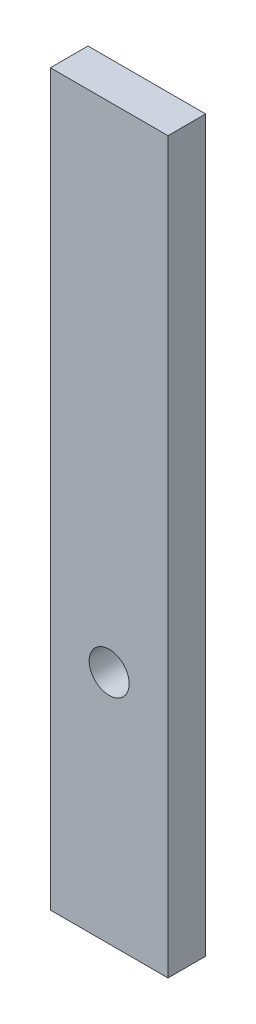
ISO-10303-21;
HEADER;
FILE_DESCRIPTION(('STEP AP214'),'2;1');
FILE_NAME('part.step','',(''),(''),'','','');
FILE_SCHEMA(('AUTOMOTIVE_DESIGN { 1 0 10303 214 1 1 1 1 }'));
ENDSEC;
DATA;
#1=APPLICATION_CONTEXT('core data for automotive mechanical design processes');
#2=APPLICATION_PROTOCOL_DEFINITION('international standard','automotive_design',2000,#1);
#3=PRODUCT_CONTEXT('',#1,'mechanical');
#4=PRODUCT('Part','Part','',(#3));
#5=PRODUCT_RELATED_PRODUCT_CATEGORY('part','',(#4));
#6=PRODUCT_DEFINITION_FORMATION('','',#4);
#7=PRODUCT_DEFINITION_CONTEXT('part definition',#1,'design');
#8=PRODUCT_DEFINITION('design','',#6,#7);
#9=PRODUCT_DEFINITION_SHAPE('','',#8);
#10=(LENGTH_UNIT() NAMED_UNIT(*) SI_UNIT(.MILLI.,.METRE.));
#11=(NAMED_UNIT(*) PLANE_ANGLE_UNIT() SI_UNIT($,.RADIAN.));
#12=(NAMED_UNIT(*) SI_UNIT($,.STERADIAN.) SOLID_ANGLE_UNIT());
#13=UNCERTAINTY_MEASURE_WITH_UNIT(LENGTH_MEASURE(1.E-05),#10,'distance_accuracy_value','');
#14=(GEOMETRIC_REPRESENTATION_CONTEXT(3) GLOBAL_UNCERTAINTY_ASSIGNED_CONTEXT((#13)) GLOBAL_UNIT_ASSIGNED_CONTEXT((#10,
#11,#12)) REPRESENTATION_CONTEXT('',''));
#15=CARTESIAN_POINT('',(0.,0.,0.));
#16=DIRECTION('',(0.,0.,1.));
#17=DIRECTION('',(1.,0.,0.));
#18=AXIS2_PLACEMENT_3D('',#15,#16,#17);
#19=CARTESIAN_POINT('',(0.,155.,0.));
#20=DIRECTION('',(0.,0.,-1.));
#21=DIRECTION('',(-1.,0.,0.));
#22=AXIS2_PLACEMENT_3D('',#19,#20,#21);
#23=PLANE('',#22);
#24=DIRECTION('',(0.,-1.,0.));
#25=VECTOR('',#24,1.);
#26=CARTESIAN_POINT('',(0.,0.,0.));
#27=LINE('',#26,#25);
#28=CARTESIAN_POINT('',(0.,155.,0.));
#29=VERTEX_POINT('',#28);
#30=CARTESIAN_POINT('',(0.,0.,0.));
#31=VERTEX_POINT('',#30);
#32=EDGE_CURVE('E113',#29,#31,#27,.T.);
#33=ORIENTED_EDGE('',*,*,#32,.F.);
#34=DIRECTION('',(-1.,0.,0.));
#35=VECTOR('',#34,1.);
#36=CARTESIAN_POINT('',(0.,155.,0.));
#37=LINE('',#36,#35);
#38=CARTESIAN_POINT('',(25.,155.,0.));
#39=VERTEX_POINT('',#38);
#40=EDGE_CURVE('E85',#39,#29,#37,.T.);
#41=ORIENTED_EDGE('',*,*,#40,.F.);
#42=DIRECTION('',(0.,1.,0.));
#43=VECTOR('',#42,1.);
#44=CARTESIAN_POINT('',(25.,0.,0.));
#45=LINE('',#44,#43);
#46=CARTESIAN_POINT('',(25.,0.,0.));
#47=VERTEX_POINT('',#46);
#48=EDGE_CURVE('E79',#47,#39,#45,.T.);
#49=ORIENTED_EDGE('',*,*,#48,.F.);
#50=DIRECTION('',(1.,0.,0.));
#51=VECTOR('',#50,1.);
#52=CARTESIAN_POINT('',(0.,0.,0.));
#53=LINE('',#52,#51);
#54=EDGE_CURVE('E102',#31,#47,#53,.T.);
#55=ORIENTED_EDGE('',*,*,#54,.F.);
#56=EDGE_LOOP('',(#33,#41,#49,#55));
#57=FACE_BOUND('',#56,.T.);
#58=CARTESIAN_POINT('',(12.5,50.,0.));
#59=DIRECTION('',(0.,0.,1.));
#60=DIRECTION('',(1.,0.,0.));
#61=AXIS2_PLACEMENT_3D('',#58,#59,#60);
#62=CIRCLE('',#61,4.25);
#63=CARTESIAN_POINT('',(16.75,50.,0.));
#64=VERTEX_POINT('',#63);
#65=EDGE_CURVE('E137',#64,#64,#62,.T.);
#66=ORIENTED_EDGE('',*,*,#65,.T.);
#67=EDGE_LOOP('',(#66));
#68=FACE_BOUND('',#67,.T.);
#69=ADVANCED_FACE('F44',(#57,#68),#23,.T.);
#70=CARTESIAN_POINT('',(0.,0.,8.));
#71=DIRECTION('',(1.,0.,0.));
#72=DIRECTION('',(0.,0.,-1.));
#73=AXIS2_PLACEMENT_3D('',#70,#71,#72);
#74=PLANE('',#73);
#75=ORIENTED_EDGE('',*,*,#32,.T.);
#76=DIRECTION('',(0.,0.,-1.));
#77=VECTOR('',#76,1.);
#78=CARTESIAN_POINT('',(0.,0.,8.));
#79=LINE('',#78,#77);
#80=CARTESIAN_POINT('',(0.,0.,8.));
#81=VERTEX_POINT('',#80);
#82=EDGE_CURVE('E11',#81,#31,#79,.T.);
#83=ORIENTED_EDGE('',*,*,#82,.F.);
#84=DIRECTION('',(0.,-1.,0.));
#85=VECTOR('',#84,1.);
#86=CARTESIAN_POINT('',(0.,0.,8.));
#87=LINE('',#86,#85);
#88=CARTESIAN_POINT('',(0.,155.,8.));
#89=VERTEX_POINT('',#88);
#90=EDGE_CURVE('E97',#89,#81,#87,.T.);
#91=ORIENTED_EDGE('',*,*,#90,.F.);
#92=DIRECTION('',(0.,0.,-1.));
#93=VECTOR('',#92,1.);
#94=CARTESIAN_POINT('',(0.,155.,8.));
#95=LINE('',#94,#93);
#96=EDGE_CURVE('E109',#89,#29,#95,.T.);
#97=ORIENTED_EDGE('',*,*,#96,.T.);
#98=EDGE_LOOP('',(#75,#83,#91,#97));
#99=FACE_BOUND('',#98,.T.);
#100=ADVANCED_FACE('F46',(#99),#74,.F.);
#101=CARTESIAN_POINT('',(0.,0.,8.));
#102=DIRECTION('',(0.,1.,0.));
#103=DIRECTION('',(0.,0.,1.));
#104=AXIS2_PLACEMENT_3D('',#101,#102,#103);
#105=PLANE('',#104);
#106=ORIENTED_EDGE('',*,*,#54,.T.);
#107=DIRECTION('',(0.,0.,-1.));
#108=VECTOR('',#107,1.);
#109=CARTESIAN_POINT('',(25.,0.,8.));
#110=LINE('',#109,#108);
#111=CARTESIAN_POINT('',(25.,0.,8.));
#112=VERTEX_POINT('',#111);
#113=EDGE_CURVE('E54',#112,#47,#110,.T.);
#114=ORIENTED_EDGE('',*,*,#113,.F.);
#115=DIRECTION('',(1.,0.,0.));
#116=VECTOR('',#115,1.);
#117=CARTESIAN_POINT('',(0.,0.,8.));
#118=LINE('',#117,#116);
#119=EDGE_CURVE('E92',#81,#112,#118,.T.);
#120=ORIENTED_EDGE('',*,*,#119,.F.);
#121=ORIENTED_EDGE('',*,*,#82,.T.);
#122=EDGE_LOOP('',(#106,#114,#120,#121));
#123=FACE_BOUND('',#122,.T.);
#124=ADVANCED_FACE('F101',(#123),#105,.F.);
#125=CARTESIAN_POINT('',(25.,0.,8.));
#126=DIRECTION('',(-1.,0.,0.));
#127=DIRECTION('',(0.,0.,1.));
#128=AXIS2_PLACEMENT_3D('',#125,#126,#127);
#129=PLANE('',#128);
#130=ORIENTED_EDGE('',*,*,#48,.T.);
#131=DIRECTION('',(0.,0.,-1.));
#132=VECTOR('',#131,1.);
#133=CARTESIAN_POINT('',(25.,155.,8.));
#134=LINE('',#133,#132);
#135=CARTESIAN_POINT('',(25.,155.,8.));
#136=VERTEX_POINT('',#135);
#137=EDGE_CURVE('E104',#136,#39,#134,.T.);
#138=ORIENTED_EDGE('',*,*,#137,.F.);
#139=DIRECTION('',(0.,1.,0.));
#140=VECTOR('',#139,1.);
#141=CARTESIAN_POINT('',(25.,0.,8.));
#142=LINE('',#141,#140);
#143=EDGE_CURVE('E95',#112,#136,#142,.T.);
#144=ORIENTED_EDGE('',*,*,#143,.F.);
#145=ORIENTED_EDGE('',*,*,#113,.T.);
#146=EDGE_LOOP('',(#130,#138,#144,#145));
#147=FACE_BOUND('',#146,.T.);
#148=ADVANCED_FACE('F105',(#147),#129,.F.);
#149=CARTESIAN_POINT('',(0.,155.,8.));
#150=DIRECTION('',(0.,-1.,0.));
#151=DIRECTION('',(0.,0.,-1.));
#152=AXIS2_PLACEMENT_3D('',#149,#150,#151);
#153=PLANE('',#152);
#154=ORIENTED_EDGE('',*,*,#40,.T.);
#155=ORIENTED_EDGE('',*,*,#96,.F.);
#156=DIRECTION('',(-1.,0.,0.));
#157=VECTOR('',#156,1.);
#158=CARTESIAN_POINT('',(0.,155.,8.));
#159=LINE('',#158,#157);
#160=EDGE_CURVE('E62',#136,#89,#159,.T.);
#161=ORIENTED_EDGE('',*,*,#160,.F.);
#162=ORIENTED_EDGE('',*,*,#137,.T.);
#163=EDGE_LOOP('',(#154,#155,#161,#162));
#164=FACE_BOUND('',#163,.T.);
#165=ADVANCED_FACE('F127',(#164),#153,.F.);
#166=CARTESIAN_POINT('',(0.,155.,8.));
#167=DIRECTION('',(0.,0.,-1.));
#168=DIRECTION('',(-1.,0.,0.));
#169=AXIS2_PLACEMENT_3D('',#166,#167,#168);
#170=PLANE('',#169);
#171=CARTESIAN_POINT('',(12.5,50.,8.));
#172=DIRECTION('',(0.,0.,1.));
#173=DIRECTION('',(1.,0.,0.));
#174=AXIS2_PLACEMENT_3D('',#171,#172,#173);
#175=CIRCLE('',#174,4.25);
#176=CARTESIAN_POINT('',(16.75,50.,8.));
#177=VERTEX_POINT('',#176);
#178=EDGE_CURVE('E117',#177,#177,#175,.T.);
#179=ORIENTED_EDGE('',*,*,#178,.F.);
#180=EDGE_LOOP('',(#179));
#181=FACE_BOUND('',#180,.T.);
#182=ORIENTED_EDGE('',*,*,#90,.T.);
#183=ORIENTED_EDGE('',*,*,#119,.T.);
#184=ORIENTED_EDGE('',*,*,#143,.T.);
#185=ORIENTED_EDGE('',*,*,#160,.T.);
#186=EDGE_LOOP('',(#182,#183,#184,#185));
#187=FACE_BOUND('',#186,.T.);
#188=ADVANCED_FACE('F93',(#181,#187),#170,.F.);
#189=CARTESIAN_POINT('',(12.5,50.,8.));
#190=DIRECTION('',(0.,0.,1.));
#191=DIRECTION('',(1.,0.,0.));
#192=AXIS2_PLACEMENT_3D('',#189,#190,#191);
#193=CYLINDRICAL_SURFACE('',#192,4.25);
#194=ORIENTED_EDGE('',*,*,#65,.F.);
#195=EDGE_LOOP('',(#194));
#196=FACE_BOUND('',#195,.T.);
#197=ORIENTED_EDGE('',*,*,#178,.T.);
#198=EDGE_LOOP('',(#197));
#199=FACE_BOUND('',#198,.T.);
#200=ADVANCED_FACE('F142',(#196,#199),#193,.F.);
#201=CLOSED_SHELL('',(#69,#100,#124,#148,#165,#188,#200));
#202=MANIFOLD_SOLID_BREP('B2',#201);
#203=ADVANCED_BREP_SHAPE_REPRESENTATION('',(#18,#202),#14);
#204=SHAPE_DEFINITION_REPRESENTATION(#9,#203);
ENDSEC;
END-ISO-10303-21;
